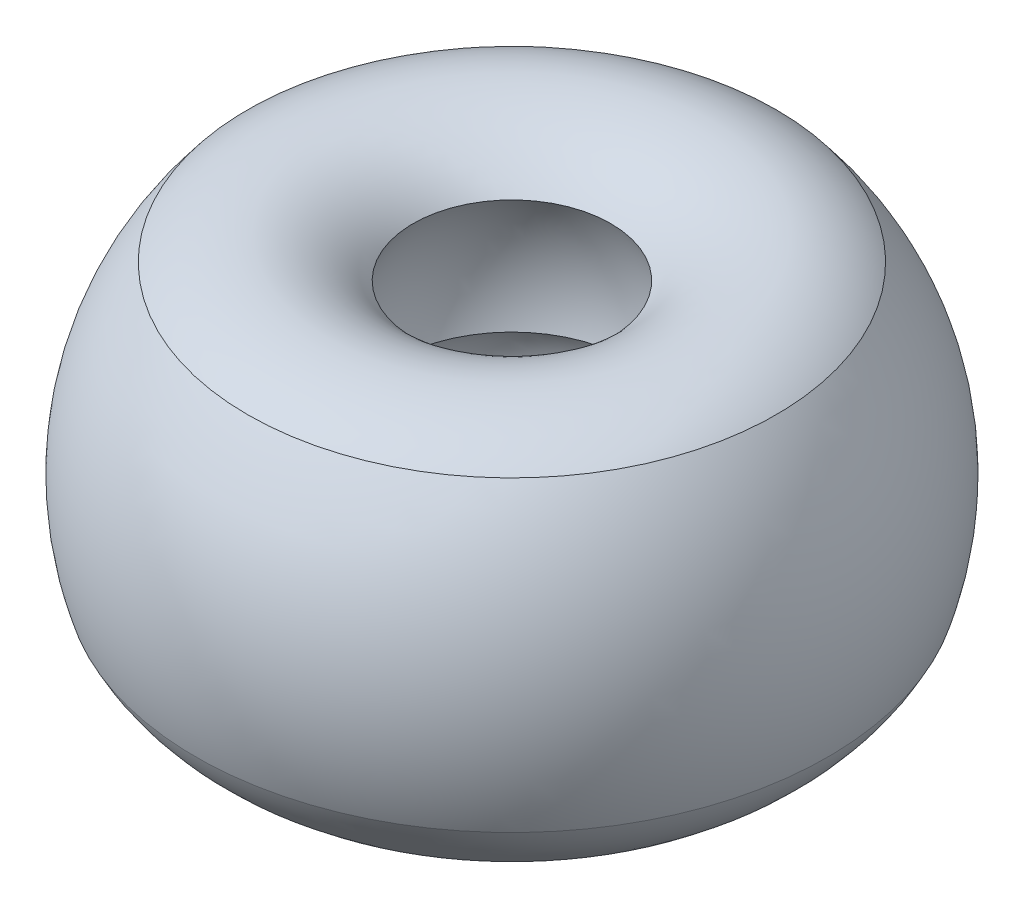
ISO-10303-21;
HEADER;
FILE_DESCRIPTION(('STEP AP214'),'2;1');
FILE_NAME('part.step','',(''),(''),'','','');
FILE_SCHEMA(('AUTOMOTIVE_DESIGN { 1 0 10303 214 1 1 1 1 }'));
ENDSEC;
DATA;
#1=APPLICATION_CONTEXT('core data for automotive mechanical design processes');
#2=APPLICATION_PROTOCOL_DEFINITION('international standard','automotive_design',2000,#1);
#3=PRODUCT_CONTEXT('',#1,'mechanical');
#4=PRODUCT('Part','Part','',(#3));
#5=PRODUCT_RELATED_PRODUCT_CATEGORY('part','',(#4));
#6=PRODUCT_DEFINITION_FORMATION('','',#4);
#7=PRODUCT_DEFINITION_CONTEXT('part definition',#1,'design');
#8=PRODUCT_DEFINITION('design','',#6,#7);
#9=PRODUCT_DEFINITION_SHAPE('','',#8);
#10=(LENGTH_UNIT() NAMED_UNIT(*) SI_UNIT(.MILLI.,.METRE.));
#11=(NAMED_UNIT(*) PLANE_ANGLE_UNIT() SI_UNIT($,.RADIAN.));
#12=(NAMED_UNIT(*) SI_UNIT($,.STERADIAN.) SOLID_ANGLE_UNIT());
#13=UNCERTAINTY_MEASURE_WITH_UNIT(LENGTH_MEASURE(1.E-05),#10,'distance_accuracy_value','');
#14=(GEOMETRIC_REPRESENTATION_CONTEXT(3) GLOBAL_UNCERTAINTY_ASSIGNED_CONTEXT((#13)) GLOBAL_UNIT_ASSIGNED_CONTEXT((#10,
#11,#12)) REPRESENTATION_CONTEXT('',''));
#15=CARTESIAN_POINT('',(0.,0.,0.));
#16=DIRECTION('',(0.,0.,1.));
#17=DIRECTION('',(1.,0.,0.));
#18=AXIS2_PLACEMENT_3D('',#15,#16,#17);
#19=CARTESIAN_POINT('',(0.,1520.86935906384,0.));
#20=DIRECTION('',(0.,-1.,0.));
#21=DIRECTION('',(0.,0.,-1.));
#22=AXIS2_PLACEMENT_3D('',#19,#20,#21);
#23=DEGENERATE_TOROIDAL_SURFACE('',#22,486.783756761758,1682.67525090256,.F.);
#24=CARTESIAN_POINT('',(0.,2376.0106941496,0.));
#25=DIRECTION('',(0.,-1.,0.));
#26=DIRECTION('',(0.,0.,-1.));
#27=AXIS2_PLACEMENT_3D('',#24,#25,#26);
#28=CIRCLE('',#27,962.39852888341);
#29=CARTESIAN_POINT('',(0.,2376.0106941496,-962.39852888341));
#30=VERTEX_POINT('',#29);
#31=EDGE_CURVE('E10',#30,#30,#28,.T.);
#32=ORIENTED_EDGE('',*,*,#31,.F.);
#33=EDGE_LOOP('',(#32));
#34=FACE_BOUND('',#33,.T.);
#35=CARTESIAN_POINT('',(0.,1129.31995126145,0.));
#36=DIRECTION('',(0.,-1.,0.));
#37=DIRECTION('',(0.,0.,-1.));
#38=AXIS2_PLACEMENT_3D('',#35,#36,#37);
#39=CIRCLE('',#38,1149.70182559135);
#40=CARTESIAN_POINT('',(0.,1129.31995126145,-1149.70182559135));
#41=VERTEX_POINT('',#40);
#42=EDGE_CURVE('E37',#41,#41,#39,.T.);
#43=ORIENTED_EDGE('',*,*,#42,.T.);
#44=EDGE_LOOP('',(#43));
#45=FACE_BOUND('',#44,.T.);
#46=ADVANCED_FACE('F15',(#34,#45),#23,.T.);
#47=CARTESIAN_POINT('',(0.,1605.14133508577,0.));
#48=DIRECTION('',(0.,-1.,0.));
#49=DIRECTION('',(0.,0.,-1.));
#50=AXIS2_PLACEMENT_3D('',#47,#48,#49);
#51=TOROIDAL_SURFACE('',#50,1849.18228564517,1174.99999999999);
#52=CARTESIAN_POINT('',(0.,2531.05397057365,0.));
#53=DIRECTION('',(0.,-1.,0.));
#54=DIRECTION('',(0.,0.,-1.));
#55=AXIS2_PLACEMENT_3D('',#52,#53,#54);
#56=CIRCLE('',#55,2572.58451915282);
#57=CARTESIAN_POINT('',(0.,2531.05397057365,-2572.58451915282));
#58=VERTEX_POINT('',#57);
#59=EDGE_CURVE('E21',#58,#58,#56,.T.);
#60=ORIENTED_EDGE('',*,*,#59,.F.);
#61=EDGE_LOOP('',(#60));
#62=FACE_BOUND('',#61,.T.);
#63=ORIENTED_EDGE('',*,*,#31,.T.);
#64=EDGE_LOOP('',(#63));
#65=FACE_BOUND('',#64,.T.);
#66=ADVANCED_FACE('F62',(#62,#65),#51,.T.);
#67=CARTESIAN_POINT('',(0.,750.,0.));
#68=DIRECTION('',(0.,-1.,0.));
#69=DIRECTION('',(0.,0.,-1.));
#70=AXIS2_PLACEMENT_3D('',#67,#68,#69);
#71=DEGENERATE_TOROIDAL_SURFACE('',#70,400.,2809.31962207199,.T.);
#72=CARTESIAN_POINT('',(0.,-102.051176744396,0.));
#73=DIRECTION('',(0.,-1.,0.));
#74=DIRECTION('',(0.,0.,-1.));
#75=AXIS2_PLACEMENT_3D('',#72,#73,#74);
#76=CIRCLE('',#75,3076.99188104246);
#77=CARTESIAN_POINT('',(0.,-102.051176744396,-3076.99188104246));
#78=VERTEX_POINT('',#77);
#79=EDGE_CURVE('E25',#78,#78,#76,.T.);
#80=ORIENTED_EDGE('',*,*,#79,.F.);
#81=EDGE_LOOP('',(#80));
#82=FACE_BOUND('',#81,.T.);
#83=ORIENTED_EDGE('',*,*,#59,.T.);
#84=EDGE_LOOP('',(#83));
#85=FACE_BOUND('',#84,.T.);
#86=ADVANCED_FACE('F57',(#82,#85),#71,.T.);
#87=CARTESIAN_POINT('',(0.,647.592002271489,0.));
#88=DIRECTION('',(0.,-1.,0.));
#89=DIRECTION('',(0.,0.,-1.));
#90=AXIS2_PLACEMENT_3D('',#87,#88,#89);
#91=DEGENERATE_TOROIDAL_SURFACE('',#90,1570.5287702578,1682.67525090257,.T.);
#92=CARTESIAN_POINT('',(0.,-756.283638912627,0.));
#93=DIRECTION('',(0.,-1.,0.));
#94=DIRECTION('',(0.,0.,-1.));
#95=AXIS2_PLACEMENT_3D('',#92,#93,#94);
#96=CIRCLE('',#95,642.881647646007);
#97=CARTESIAN_POINT('',(0.,-756.283638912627,-642.881647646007));
#98=VERTEX_POINT('',#97);
#99=EDGE_CURVE('E29',#98,#98,#96,.T.);
#100=ORIENTED_EDGE('',*,*,#99,.F.);
#101=EDGE_LOOP('',(#100));
#102=FACE_BOUND('',#101,.T.);
#103=ORIENTED_EDGE('',*,*,#79,.T.);
#104=EDGE_LOOP('',(#103));
#105=FACE_BOUND('',#104,.T.);
#106=ADVANCED_FACE('F51',(#102,#105),#91,.T.);
#107=CARTESIAN_POINT('',(0.,0.,0.));
#108=DIRECTION('',(0.,-1.,0.));
#109=DIRECTION('',(0.,0.,-1.));
#110=AXIS2_PLACEMENT_3D('',#107,#108,#109);
#111=CYLINDRICAL_SURFACE('',#110,642.881647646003);
#112=CARTESIAN_POINT('',(0.,-54.3288866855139,0.));
#113=DIRECTION('',(0.,-1.,0.));
#114=DIRECTION('',(0.,0.,-1.));
#115=AXIS2_PLACEMENT_3D('',#112,#113,#114);
#116=CIRCLE('',#115,642.881647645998);
#117=CARTESIAN_POINT('',(0.,-54.3288866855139,-642.881647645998));
#118=VERTEX_POINT('',#117);
#119=EDGE_CURVE('E34',#118,#118,#116,.T.);
#120=ORIENTED_EDGE('',*,*,#119,.F.);
#121=EDGE_LOOP('',(#120));
#122=FACE_BOUND('',#121,.T.);
#123=ORIENTED_EDGE('',*,*,#99,.T.);
#124=EDGE_LOOP('',(#123));
#125=FACE_BOUND('',#124,.T.);
#126=ADVANCED_FACE('F45',(#122,#125),#111,.F.);
#127=CARTESIAN_POINT('',(0.,750.,0.));
#128=DIRECTION('',(0.,-1.,0.));
#129=DIRECTION('',(0.,0.,-1.));
#130=AXIS2_PLACEMENT_3D('',#127,#128,#129);
#131=DEGENERATE_TOROIDAL_SURFACE('',#130,400.,840.200245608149,.T.);
#132=ORIENTED_EDGE('',*,*,#42,.F.);
#133=EDGE_LOOP('',(#132));
#134=FACE_BOUND('',#133,.T.);
#135=ORIENTED_EDGE('',*,*,#119,.T.);
#136=EDGE_LOOP('',(#135));
#137=FACE_BOUND('',#136,.T.);
#138=ADVANCED_FACE('F42',(#134,#137),#131,.F.);
#139=CLOSED_SHELL('',(#46,#66,#86,#106,#126,#138));
#140=MANIFOLD_SOLID_BREP('B1',#139);
#141=ADVANCED_BREP_SHAPE_REPRESENTATION('',(#18,#140),#14);
#142=SHAPE_DEFINITION_REPRESENTATION(#9,#141);
ENDSEC;
END-ISO-10303-21;
